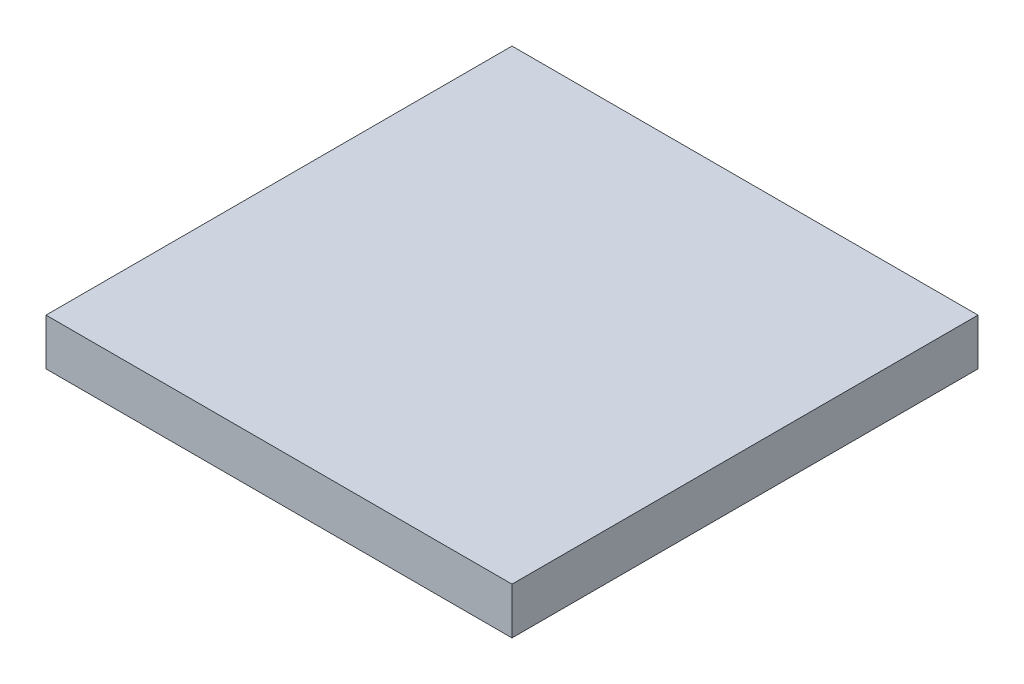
ISO-10303-21;
HEADER;
FILE_DESCRIPTION(('STEP AP214'),'2;1');
FILE_NAME('part.step','',(''),(''),'','','');
FILE_SCHEMA(('AUTOMOTIVE_DESIGN { 1 0 10303 214 1 1 1 1 }'));
ENDSEC;
DATA;
#1=APPLICATION_CONTEXT('core data for automotive mechanical design processes');
#2=APPLICATION_PROTOCOL_DEFINITION('international standard','automotive_design',2000,#1);
#3=PRODUCT_CONTEXT('',#1,'mechanical');
#4=PRODUCT('Part','Part','',(#3));
#5=PRODUCT_RELATED_PRODUCT_CATEGORY('part','',(#4));
#6=PRODUCT_DEFINITION_FORMATION('','',#4);
#7=PRODUCT_DEFINITION_CONTEXT('part definition',#1,'design');
#8=PRODUCT_DEFINITION('design','',#6,#7);
#9=PRODUCT_DEFINITION_SHAPE('','',#8);
#10=(LENGTH_UNIT() NAMED_UNIT(*) SI_UNIT(.MILLI.,.METRE.));
#11=(NAMED_UNIT(*) PLANE_ANGLE_UNIT() SI_UNIT($,.RADIAN.));
#12=(NAMED_UNIT(*) SI_UNIT($,.STERADIAN.) SOLID_ANGLE_UNIT());
#13=UNCERTAINTY_MEASURE_WITH_UNIT(LENGTH_MEASURE(1.E-05),#10,'distance_accuracy_value','');
#14=(GEOMETRIC_REPRESENTATION_CONTEXT(3) GLOBAL_UNCERTAINTY_ASSIGNED_CONTEXT((#13)) GLOBAL_UNIT_ASSIGNED_CONTEXT((#10,
#11,#12)) REPRESENTATION_CONTEXT('',''));
#15=CARTESIAN_POINT('',(0.,0.,0.));
#16=DIRECTION('',(0.,0.,1.));
#17=DIRECTION('',(1.,0.,0.));
#18=AXIS2_PLACEMENT_3D('',#15,#16,#17);
#19=CARTESIAN_POINT('',(0.,4.,0.));
#20=DIRECTION('',(1.,0.,0.));
#21=DIRECTION('',(0.,0.,-1.));
#22=AXIS2_PLACEMENT_3D('',#19,#20,#21);
#23=PLANE('',#22);
#24=DIRECTION('',(0.,0.,1.));
#25=VECTOR('',#24,1.);
#26=CARTESIAN_POINT('',(0.,0.,0.));
#27=LINE('',#26,#25);
#28=CARTESIAN_POINT('',(0.,0.,-40.));
#29=VERTEX_POINT('',#28);
#30=CARTESIAN_POINT('',(0.,0.,0.));
#31=VERTEX_POINT('',#30);
#32=EDGE_CURVE('E94',#29,#31,#27,.T.);
#33=ORIENTED_EDGE('',*,*,#32,.T.);
#34=DIRECTION('',(0.,-1.,0.));
#35=VECTOR('',#34,1.);
#36=CARTESIAN_POINT('',(0.,4.,0.));
#37=LINE('',#36,#35);
#38=CARTESIAN_POINT('',(0.,4.,0.));
#39=VERTEX_POINT('',#38);
#40=EDGE_CURVE('E11',#39,#31,#37,.T.);
#41=ORIENTED_EDGE('',*,*,#40,.F.);
#42=DIRECTION('',(0.,0.,1.));
#43=VECTOR('',#42,1.);
#44=CARTESIAN_POINT('',(0.,4.,0.));
#45=LINE('',#44,#43);
#46=CARTESIAN_POINT('',(0.,4.,-40.));
#47=VERTEX_POINT('',#46);
#48=EDGE_CURVE('E82',#47,#39,#45,.T.);
#49=ORIENTED_EDGE('',*,*,#48,.F.);
#50=DIRECTION('',(0.,-1.,0.));
#51=VECTOR('',#50,1.);
#52=CARTESIAN_POINT('',(0.,4.,-40.));
#53=LINE('',#52,#51);
#54=EDGE_CURVE('E90',#47,#29,#53,.T.);
#55=ORIENTED_EDGE('',*,*,#54,.T.);
#56=EDGE_LOOP('',(#33,#41,#49,#55));
#57=FACE_BOUND('',#56,.T.);
#58=ADVANCED_FACE('F31',(#57),#23,.F.);
#59=CARTESIAN_POINT('',(0.,4.,0.));
#60=DIRECTION('',(0.,0.,-1.));
#61=DIRECTION('',(-1.,0.,0.));
#62=AXIS2_PLACEMENT_3D('',#59,#60,#61);
#63=PLANE('',#62);
#64=DIRECTION('',(1.,0.,0.));
#65=VECTOR('',#64,1.);
#66=CARTESIAN_POINT('',(0.,0.,0.));
#67=LINE('',#66,#65);
#68=CARTESIAN_POINT('',(40.,0.,0.));
#69=VERTEX_POINT('',#68);
#70=EDGE_CURVE('E86',#31,#69,#67,.T.);
#71=ORIENTED_EDGE('',*,*,#70,.T.);
#72=DIRECTION('',(0.,-1.,0.));
#73=VECTOR('',#72,1.);
#74=CARTESIAN_POINT('',(40.,4.,0.));
#75=LINE('',#74,#73);
#76=CARTESIAN_POINT('',(40.,4.,0.));
#77=VERTEX_POINT('',#76);
#78=EDGE_CURVE('E39',#77,#69,#75,.T.);
#79=ORIENTED_EDGE('',*,*,#78,.F.);
#80=DIRECTION('',(1.,0.,0.));
#81=VECTOR('',#80,1.);
#82=CARTESIAN_POINT('',(0.,4.,0.));
#83=LINE('',#82,#81);
#84=EDGE_CURVE('E77',#39,#77,#83,.T.);
#85=ORIENTED_EDGE('',*,*,#84,.F.);
#86=ORIENTED_EDGE('',*,*,#40,.T.);
#87=EDGE_LOOP('',(#71,#79,#85,#86));
#88=FACE_BOUND('',#87,.T.);
#89=ADVANCED_FACE('F85',(#88),#63,.F.);
#90=CARTESIAN_POINT('',(40.,4.,0.));
#91=DIRECTION('',(-1.,0.,0.));
#92=DIRECTION('',(0.,0.,1.));
#93=AXIS2_PLACEMENT_3D('',#90,#91,#92);
#94=PLANE('',#93);
#95=DIRECTION('',(0.,0.,-1.));
#96=VECTOR('',#95,1.);
#97=CARTESIAN_POINT('',(40.,0.,0.));
#98=LINE('',#97,#96);
#99=CARTESIAN_POINT('',(40.,0.,-40.));
#100=VERTEX_POINT('',#99);
#101=EDGE_CURVE('E64',#69,#100,#98,.T.);
#102=ORIENTED_EDGE('',*,*,#101,.T.);
#103=DIRECTION('',(0.,-1.,0.));
#104=VECTOR('',#103,1.);
#105=CARTESIAN_POINT('',(40.,4.,-40.));
#106=LINE('',#105,#104);
#107=CARTESIAN_POINT('',(40.,4.,-40.));
#108=VERTEX_POINT('',#107);
#109=EDGE_CURVE('E87',#108,#100,#106,.T.);
#110=ORIENTED_EDGE('',*,*,#109,.F.);
#111=DIRECTION('',(0.,0.,-1.));
#112=VECTOR('',#111,1.);
#113=CARTESIAN_POINT('',(40.,4.,0.));
#114=LINE('',#113,#112);
#115=EDGE_CURVE('E80',#77,#108,#114,.T.);
#116=ORIENTED_EDGE('',*,*,#115,.F.);
#117=ORIENTED_EDGE('',*,*,#78,.T.);
#118=EDGE_LOOP('',(#102,#110,#116,#117));
#119=FACE_BOUND('',#118,.T.);
#120=ADVANCED_FACE('F88',(#119),#94,.F.);
#121=CARTESIAN_POINT('',(0.,4.,-40.));
#122=DIRECTION('',(0.,0.,1.));
#123=DIRECTION('',(1.,0.,0.));
#124=AXIS2_PLACEMENT_3D('',#121,#122,#123);
#125=PLANE('',#124);
#126=DIRECTION('',(-1.,0.,0.));
#127=VECTOR('',#126,1.);
#128=CARTESIAN_POINT('',(0.,0.,-40.));
#129=LINE('',#128,#127);
#130=EDGE_CURVE('E70',#100,#29,#129,.T.);
#131=ORIENTED_EDGE('',*,*,#130,.T.);
#132=ORIENTED_EDGE('',*,*,#54,.F.);
#133=DIRECTION('',(-1.,0.,0.));
#134=VECTOR('',#133,1.);
#135=CARTESIAN_POINT('',(0.,4.,-40.));
#136=LINE('',#135,#134);
#137=EDGE_CURVE('E47',#108,#47,#136,.T.);
#138=ORIENTED_EDGE('',*,*,#137,.F.);
#139=ORIENTED_EDGE('',*,*,#109,.T.);
#140=EDGE_LOOP('',(#131,#132,#138,#139));
#141=FACE_BOUND('',#140,.T.);
#142=ADVANCED_FACE('F101',(#141),#125,.F.);
#143=CARTESIAN_POINT('',(0.,4.,-40.));
#144=DIRECTION('',(0.,-1.,0.));
#145=DIRECTION('',(0.,0.,-1.));
#146=AXIS2_PLACEMENT_3D('',#143,#144,#145);
#147=PLANE('',#146);
#148=ORIENTED_EDGE('',*,*,#48,.T.);
#149=ORIENTED_EDGE('',*,*,#84,.T.);
#150=ORIENTED_EDGE('',*,*,#115,.T.);
#151=ORIENTED_EDGE('',*,*,#137,.T.);
#152=EDGE_LOOP('',(#148,#149,#150,#151));
#153=FACE_BOUND('',#152,.T.);
#154=ADVANCED_FACE('F78',(#153),#147,.F.);
#155=CARTESIAN_POINT('',(0.,0.,-40.));
#156=DIRECTION('',(0.,-1.,0.));
#157=DIRECTION('',(0.,0.,-1.));
#158=AXIS2_PLACEMENT_3D('',#155,#156,#157);
#159=PLANE('',#158);
#160=ORIENTED_EDGE('',*,*,#32,.F.);
#161=ORIENTED_EDGE('',*,*,#130,.F.);
#162=ORIENTED_EDGE('',*,*,#101,.F.);
#163=ORIENTED_EDGE('',*,*,#70,.F.);
#164=EDGE_LOOP('',(#160,#161,#162,#163));
#165=FACE_BOUND('',#164,.T.);
#166=ADVANCED_FACE('F104',(#165),#159,.T.);
#167=CLOSED_SHELL('',(#58,#89,#120,#142,#154,#166));
#168=MANIFOLD_SOLID_BREP('B2',#167);
#169=ADVANCED_BREP_SHAPE_REPRESENTATION('',(#18,#168),#14);
#170=SHAPE_DEFINITION_REPRESENTATION(#9,#169);
ENDSEC;
END-ISO-10303-21;
